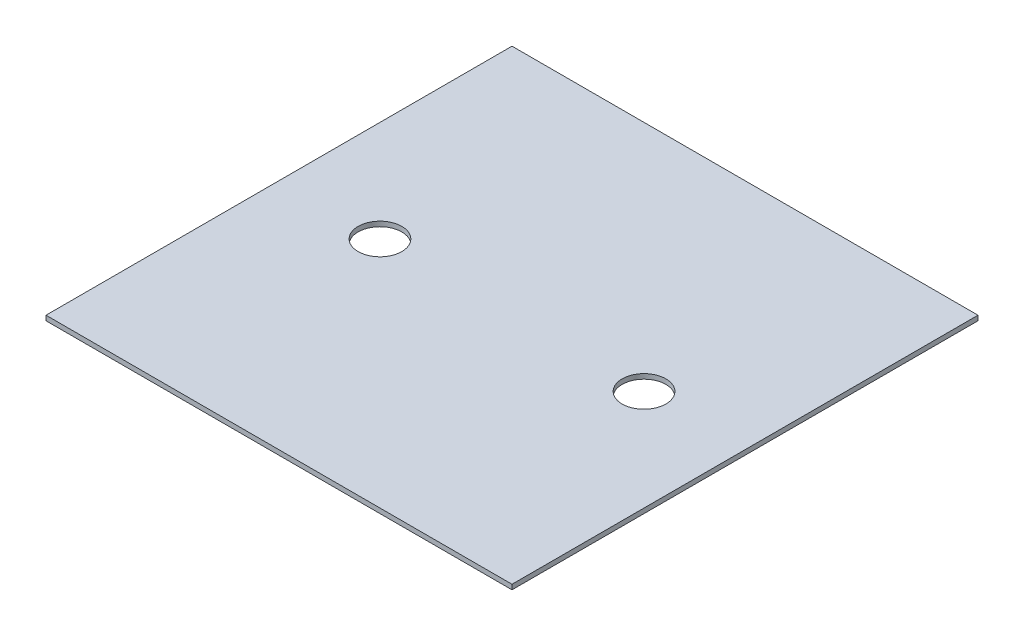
ISO-10303-21;
HEADER;
FILE_DESCRIPTION(('STEP AP214'),'2;1');
FILE_NAME('part.step','',(''),(''),'','','');
FILE_SCHEMA(('AUTOMOTIVE_DESIGN { 1 0 10303 214 1 1 1 1 }'));
ENDSEC;
DATA;
#1=APPLICATION_CONTEXT('core data for automotive mechanical design processes');
#2=APPLICATION_PROTOCOL_DEFINITION('international standard','automotive_design',2000,#1);
#3=PRODUCT_CONTEXT('',#1,'mechanical');
#4=PRODUCT('Part','Part','',(#3));
#5=PRODUCT_RELATED_PRODUCT_CATEGORY('part','',(#4));
#6=PRODUCT_DEFINITION_FORMATION('','',#4);
#7=PRODUCT_DEFINITION_CONTEXT('part definition',#1,'design');
#8=PRODUCT_DEFINITION('design','',#6,#7);
#9=PRODUCT_DEFINITION_SHAPE('','',#8);
#10=(LENGTH_UNIT() NAMED_UNIT(*) SI_UNIT(.MILLI.,.METRE.));
#11=(NAMED_UNIT(*) PLANE_ANGLE_UNIT() SI_UNIT($,.RADIAN.));
#12=(NAMED_UNIT(*) SI_UNIT($,.STERADIAN.) SOLID_ANGLE_UNIT());
#13=UNCERTAINTY_MEASURE_WITH_UNIT(LENGTH_MEASURE(1.E-05),#10,'distance_accuracy_value','');
#14=(GEOMETRIC_REPRESENTATION_CONTEXT(3) GLOBAL_UNCERTAINTY_ASSIGNED_CONTEXT((#13)) GLOBAL_UNIT_ASSIGNED_CONTEXT((#10,
#11,#12)) REPRESENTATION_CONTEXT('',''));
#15=CARTESIAN_POINT('',(0.,0.,0.));
#16=DIRECTION('',(0.,0.,1.));
#17=DIRECTION('',(1.,0.,0.));
#18=AXIS2_PLACEMENT_3D('',#15,#16,#17);
#19=CARTESIAN_POINT('',(-76.2,1.5875,-76.2));
#20=DIRECTION('',(1.,0.,0.));
#21=DIRECTION('',(0.,0.,-1.));
#22=AXIS2_PLACEMENT_3D('',#19,#20,#21);
#23=PLANE('',#22);
#24=DIRECTION('',(0.,0.,1.));
#25=VECTOR('',#24,1.);
#26=CARTESIAN_POINT('',(-76.2,0.,-76.2));
#27=LINE('',#26,#25);
#28=CARTESIAN_POINT('',(-76.2,0.,-76.2));
#29=VERTEX_POINT('',#28);
#30=CARTESIAN_POINT('',(-76.2,0.,76.2));
#31=VERTEX_POINT('',#30);
#32=EDGE_CURVE('E96',#29,#31,#27,.T.);
#33=ORIENTED_EDGE('',*,*,#32,.T.);
#34=DIRECTION('',(0.,-1.,0.));
#35=VECTOR('',#34,1.);
#36=CARTESIAN_POINT('',(-76.2,1.5875,76.2));
#37=LINE('',#36,#35);
#38=CARTESIAN_POINT('',(-76.2,1.5875,76.2));
#39=VERTEX_POINT('',#38);
#40=EDGE_CURVE('E11',#39,#31,#37,.T.);
#41=ORIENTED_EDGE('',*,*,#40,.F.);
#42=DIRECTION('',(0.,0.,1.));
#43=VECTOR('',#42,1.);
#44=CARTESIAN_POINT('',(-76.2,1.5875,-76.2));
#45=LINE('',#44,#43);
#46=CARTESIAN_POINT('',(-76.2,1.5875,-76.2));
#47=VERTEX_POINT('',#46);
#48=EDGE_CURVE('E84',#47,#39,#45,.T.);
#49=ORIENTED_EDGE('',*,*,#48,.F.);
#50=DIRECTION('',(0.,-1.,0.));
#51=VECTOR('',#50,1.);
#52=CARTESIAN_POINT('',(-76.2,1.5875,-76.2));
#53=LINE('',#52,#51);
#54=EDGE_CURVE('E92',#47,#29,#53,.T.);
#55=ORIENTED_EDGE('',*,*,#54,.T.);
#56=EDGE_LOOP('',(#33,#41,#49,#55));
#57=FACE_BOUND('',#56,.T.);
#58=ADVANCED_FACE('F33',(#57),#23,.F.);
#59=CARTESIAN_POINT('',(-76.2,1.5875,76.2));
#60=DIRECTION('',(0.,0.,-1.));
#61=DIRECTION('',(-1.,0.,0.));
#62=AXIS2_PLACEMENT_3D('',#59,#60,#61);
#63=PLANE('',#62);
#64=DIRECTION('',(1.,0.,0.));
#65=VECTOR('',#64,1.);
#66=CARTESIAN_POINT('',(-76.2,0.,76.2));
#67=LINE('',#66,#65);
#68=CARTESIAN_POINT('',(76.2,0.,76.2));
#69=VERTEX_POINT('',#68);
#70=EDGE_CURVE('E88',#31,#69,#67,.T.);
#71=ORIENTED_EDGE('',*,*,#70,.T.);
#72=DIRECTION('',(0.,-1.,0.));
#73=VECTOR('',#72,1.);
#74=CARTESIAN_POINT('',(76.2,1.5875,76.2));
#75=LINE('',#74,#73);
#76=CARTESIAN_POINT('',(76.2,1.5875,76.2));
#77=VERTEX_POINT('',#76);
#78=EDGE_CURVE('E41',#77,#69,#75,.T.);
#79=ORIENTED_EDGE('',*,*,#78,.F.);
#80=DIRECTION('',(1.,0.,0.));
#81=VECTOR('',#80,1.);
#82=CARTESIAN_POINT('',(-76.2,1.5875,76.2));
#83=LINE('',#82,#81);
#84=EDGE_CURVE('E79',#39,#77,#83,.T.);
#85=ORIENTED_EDGE('',*,*,#84,.F.);
#86=ORIENTED_EDGE('',*,*,#40,.T.);
#87=EDGE_LOOP('',(#71,#79,#85,#86));
#88=FACE_BOUND('',#87,.T.);
#89=ADVANCED_FACE('F87',(#88),#63,.F.);
#90=CARTESIAN_POINT('',(76.2,1.5875,-76.2));
#91=DIRECTION('',(-1.,0.,0.));
#92=DIRECTION('',(0.,0.,1.));
#93=AXIS2_PLACEMENT_3D('',#90,#91,#92);
#94=PLANE('',#93);
#95=DIRECTION('',(0.,0.,-1.));
#96=VECTOR('',#95,1.);
#97=CARTESIAN_POINT('',(76.2,0.,-76.2));
#98=LINE('',#97,#96);
#99=CARTESIAN_POINT('',(76.2,0.,-76.2));
#100=VERTEX_POINT('',#99);
#101=EDGE_CURVE('E66',#69,#100,#98,.T.);
#102=ORIENTED_EDGE('',*,*,#101,.T.);
#103=DIRECTION('',(0.,-1.,0.));
#104=VECTOR('',#103,1.);
#105=CARTESIAN_POINT('',(76.2,1.5875,-76.2));
#106=LINE('',#105,#104);
#107=CARTESIAN_POINT('',(76.2,1.5875,-76.2));
#108=VERTEX_POINT('',#107);
#109=EDGE_CURVE('E89',#108,#100,#106,.T.);
#110=ORIENTED_EDGE('',*,*,#109,.F.);
#111=DIRECTION('',(0.,0.,-1.));
#112=VECTOR('',#111,1.);
#113=CARTESIAN_POINT('',(76.2,1.5875,-76.2));
#114=LINE('',#113,#112);
#115=EDGE_CURVE('E82',#77,#108,#114,.T.);
#116=ORIENTED_EDGE('',*,*,#115,.F.);
#117=ORIENTED_EDGE('',*,*,#78,.T.);
#118=EDGE_LOOP('',(#102,#110,#116,#117));
#119=FACE_BOUND('',#118,.T.);
#120=ADVANCED_FACE('F90',(#119),#94,.F.);
#121=CARTESIAN_POINT('',(-76.2,1.5875,-76.2));
#122=DIRECTION('',(0.,0.,1.));
#123=DIRECTION('',(1.,0.,0.));
#124=AXIS2_PLACEMENT_3D('',#121,#122,#123);
#125=PLANE('',#124);
#126=DIRECTION('',(-1.,0.,0.));
#127=VECTOR('',#126,1.);
#128=CARTESIAN_POINT('',(-76.2,0.,-76.2));
#129=LINE('',#128,#127);
#130=EDGE_CURVE('E72',#100,#29,#129,.T.);
#131=ORIENTED_EDGE('',*,*,#130,.T.);
#132=ORIENTED_EDGE('',*,*,#54,.F.);
#133=DIRECTION('',(-1.,0.,0.));
#134=VECTOR('',#133,1.);
#135=CARTESIAN_POINT('',(-76.2,1.5875,-76.2));
#136=LINE('',#135,#134);
#137=EDGE_CURVE('E49',#108,#47,#136,.T.);
#138=ORIENTED_EDGE('',*,*,#137,.F.);
#139=ORIENTED_EDGE('',*,*,#109,.T.);
#140=EDGE_LOOP('',(#131,#132,#138,#139));
#141=FACE_BOUND('',#140,.T.);
#142=ADVANCED_FACE('F104',(#141),#125,.F.);
#143=CARTESIAN_POINT('',(0.,1.5875,0.));
#144=DIRECTION('',(0.,1.,0.));
#145=DIRECTION('',(0.,0.,1.));
#146=AXIS2_PLACEMENT_3D('',#143,#144,#145);
#147=PLANE('',#146);
#148=CARTESIAN_POINT('',(-43.18,1.5875,0.));
#149=DIRECTION('',(0.,1.,0.));
#150=DIRECTION('',(0.,0.,1.));
#151=AXIS2_PLACEMENT_3D('',#148,#149,#150);
#152=CIRCLE('',#151,7.14375);
#153=CARTESIAN_POINT('',(-43.18,1.5875,7.14375));
#154=VERTEX_POINT('',#153);
#155=EDGE_CURVE('E99',#154,#154,#152,.F.);
#156=ORIENTED_EDGE('',*,*,#155,.T.);
#157=EDGE_LOOP('',(#156));
#158=FACE_BOUND('',#157,.T.);
#159=CARTESIAN_POINT('',(43.18,1.5875,0.));
#160=DIRECTION('',(0.,1.,0.));
#161=DIRECTION('',(0.,0.,1.));
#162=AXIS2_PLACEMENT_3D('',#159,#160,#161);
#163=CIRCLE('',#162,7.14375);
#164=CARTESIAN_POINT('',(43.18,1.5875,7.14375));
#165=VERTEX_POINT('',#164);
#166=EDGE_CURVE('E112',#165,#165,#163,.F.);
#167=ORIENTED_EDGE('',*,*,#166,.T.);
#168=EDGE_LOOP('',(#167));
#169=FACE_BOUND('',#168,.T.);
#170=ORIENTED_EDGE('',*,*,#48,.T.);
#171=ORIENTED_EDGE('',*,*,#84,.T.);
#172=ORIENTED_EDGE('',*,*,#115,.T.);
#173=ORIENTED_EDGE('',*,*,#137,.T.);
#174=EDGE_LOOP('',(#170,#171,#172,#173));
#175=FACE_BOUND('',#174,.T.);
#176=ADVANCED_FACE('F80',(#158,#169,#175),#147,.T.);
#177=CARTESIAN_POINT('',(0.,0.,0.));
#178=DIRECTION('',(0.,1.,0.));
#179=DIRECTION('',(0.,0.,1.));
#180=AXIS2_PLACEMENT_3D('',#177,#178,#179);
#181=PLANE('',#180);
#182=CARTESIAN_POINT('',(-43.18,0.,0.));
#183=DIRECTION('',(0.,1.,0.));
#184=DIRECTION('',(0.,0.,1.));
#185=AXIS2_PLACEMENT_3D('',#182,#183,#184);
#186=CIRCLE('',#185,7.14375);
#187=CARTESIAN_POINT('',(-43.18,0.,7.14375));
#188=VERTEX_POINT('',#187);
#189=EDGE_CURVE('E115',#188,#188,#186,.T.);
#190=ORIENTED_EDGE('',*,*,#189,.T.);
#191=EDGE_LOOP('',(#190));
#192=FACE_BOUND('',#191,.T.);
#193=CARTESIAN_POINT('',(43.18,0.,0.));
#194=DIRECTION('',(0.,1.,0.));
#195=DIRECTION('',(0.,0.,1.));
#196=AXIS2_PLACEMENT_3D('',#193,#194,#195);
#197=CIRCLE('',#196,7.14375);
#198=CARTESIAN_POINT('',(43.18,0.,7.14375));
#199=VERTEX_POINT('',#198);
#200=EDGE_CURVE('E116',#199,#199,#197,.T.);
#201=ORIENTED_EDGE('',*,*,#200,.T.);
#202=EDGE_LOOP('',(#201));
#203=FACE_BOUND('',#202,.T.);
#204=ORIENTED_EDGE('',*,*,#32,.F.);
#205=ORIENTED_EDGE('',*,*,#130,.F.);
#206=ORIENTED_EDGE('',*,*,#101,.F.);
#207=ORIENTED_EDGE('',*,*,#70,.F.);
#208=EDGE_LOOP('',(#204,#205,#206,#207));
#209=FACE_BOUND('',#208,.T.);
#210=ADVANCED_FACE('F107',(#192,#203,#209),#181,.F.);
#211=CARTESIAN_POINT('',(43.18,25.4,0.));
#212=DIRECTION('',(0.,-1.,0.));
#213=DIRECTION('',(0.,0.,-1.));
#214=AXIS2_PLACEMENT_3D('',#211,#212,#213);
#215=CYLINDRICAL_SURFACE('',#214,7.14375);
#216=ORIENTED_EDGE('',*,*,#166,.F.);
#217=EDGE_LOOP('',(#216));
#218=FACE_BOUND('',#217,.T.);
#219=ORIENTED_EDGE('',*,*,#200,.F.);
#220=EDGE_LOOP('',(#219));
#221=FACE_BOUND('',#220,.T.);
#222=ADVANCED_FACE('F126',(#218,#221),#215,.F.);
#223=CARTESIAN_POINT('',(-43.18,25.4,0.));
#224=DIRECTION('',(0.,-1.,0.));
#225=DIRECTION('',(0.,0.,-1.));
#226=AXIS2_PLACEMENT_3D('',#223,#224,#225);
#227=CYLINDRICAL_SURFACE('',#226,7.14375);
#228=ORIENTED_EDGE('',*,*,#155,.F.);
#229=EDGE_LOOP('',(#228));
#230=FACE_BOUND('',#229,.T.);
#231=ORIENTED_EDGE('',*,*,#189,.F.);
#232=EDGE_LOOP('',(#231));
#233=FACE_BOUND('',#232,.T.);
#234=ADVANCED_FACE('F124',(#230,#233),#227,.F.);
#235=CLOSED_SHELL('',(#58,#89,#120,#142,#176,#210,#222,#234));
#236=MANIFOLD_SOLID_BREP('B2',#235);
#237=ADVANCED_BREP_SHAPE_REPRESENTATION('',(#18,#236),#14);
#238=SHAPE_DEFINITION_REPRESENTATION(#9,#237);
ENDSEC;
END-ISO-10303-21;
